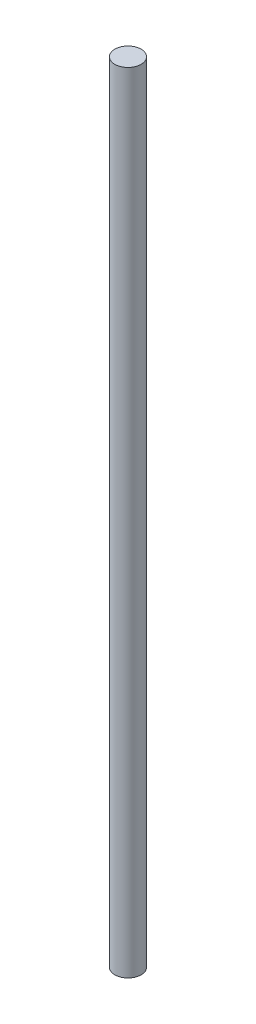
from build123d import *

# Parameters (mm, degrees)
SKETCH1_R      = 1.25
EXTRUDE1_DEPTH = 75


with BuildPart() as part:
    # Sketch1 → Extrude1 (new body)
    with BuildSketch(Plane(origin=(0, 0, 0), x_dir=(1, 0, 0), z_dir=(0, 1, 0))):
        with Locations(Location((0, 0, 0), (0, 0, 270))):
            Circle(SKETCH1_R)
    extrude(amount=EXTRUDE1_DEPTH)


solid = part.part
